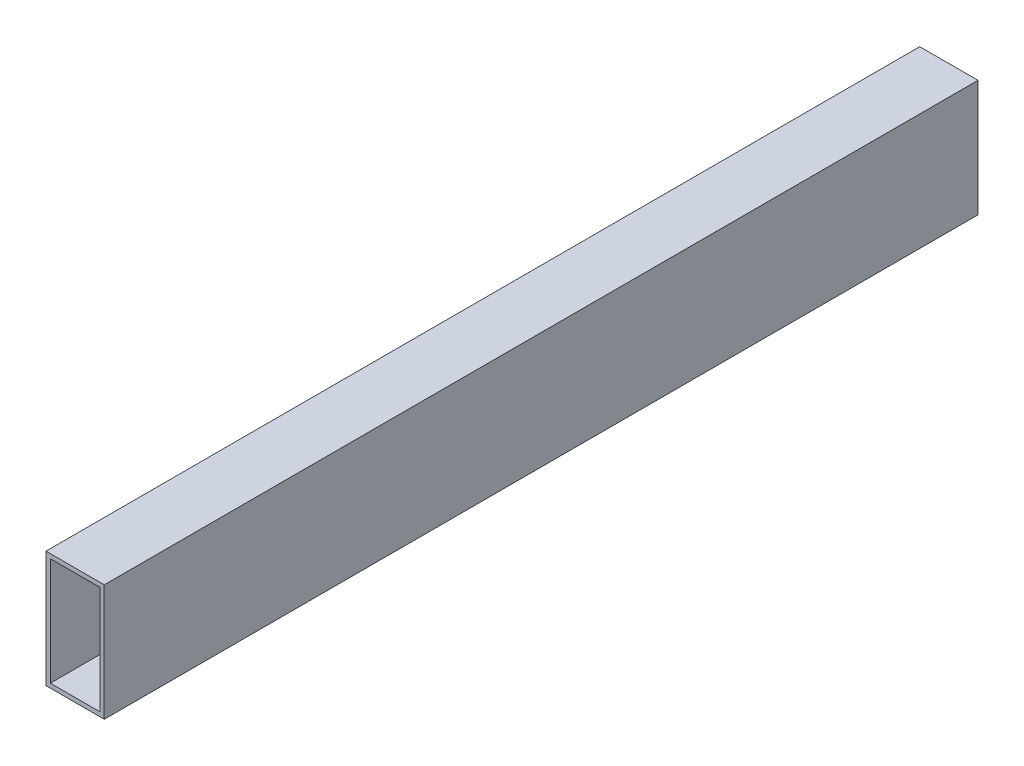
ISO-10303-21;
HEADER;
FILE_DESCRIPTION(('STEP AP214'),'2;1');
FILE_NAME('part.step','',(''),(''),'','','');
FILE_SCHEMA(('AUTOMOTIVE_DESIGN { 1 0 10303 214 1 1 1 1 }'));
ENDSEC;
DATA;
#1=APPLICATION_CONTEXT('core data for automotive mechanical design processes');
#2=APPLICATION_PROTOCOL_DEFINITION('international standard','automotive_design',2000,#1);
#3=PRODUCT_CONTEXT('',#1,'mechanical');
#4=PRODUCT('Part','Part','',(#3));
#5=PRODUCT_RELATED_PRODUCT_CATEGORY('part','',(#4));
#6=PRODUCT_DEFINITION_FORMATION('','',#4);
#7=PRODUCT_DEFINITION_CONTEXT('part definition',#1,'design');
#8=PRODUCT_DEFINITION('design','',#6,#7);
#9=PRODUCT_DEFINITION_SHAPE('','',#8);
#10=(LENGTH_UNIT() NAMED_UNIT(*) SI_UNIT(.MILLI.,.METRE.));
#11=(NAMED_UNIT(*) PLANE_ANGLE_UNIT() SI_UNIT($,.RADIAN.));
#12=(NAMED_UNIT(*) SI_UNIT($,.STERADIAN.) SOLID_ANGLE_UNIT());
#13=UNCERTAINTY_MEASURE_WITH_UNIT(LENGTH_MEASURE(1.E-05),#10,'distance_accuracy_value','');
#14=(GEOMETRIC_REPRESENTATION_CONTEXT(3) GLOBAL_UNCERTAINTY_ASSIGNED_CONTEXT((#13)) GLOBAL_UNIT_ASSIGNED_CONTEXT((#10,
#11,#12)) REPRESENTATION_CONTEXT('',''));
#15=CARTESIAN_POINT('',(0.,0.,0.));
#16=DIRECTION('',(0.,0.,1.));
#17=DIRECTION('',(1.,0.,0.));
#18=AXIS2_PLACEMENT_3D('',#15,#16,#17);
#19=CARTESIAN_POINT('',(-3659.88097263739,3096.4066057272,600.));
#20=DIRECTION('',(0.,0.,1.));
#21=DIRECTION('',(1.,0.,0.));
#22=AXIS2_PLACEMENT_3D('',#19,#20,#21);
#23=PLANE('',#22);
#24=DIRECTION('',(0.,-1.,0.));
#25=VECTOR('',#24,1.);
#26=CARTESIAN_POINT('',(-3659.88097263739,3176.4066057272,600.));
#27=LINE('',#26,#25);
#28=CARTESIAN_POINT('',(-3659.88097263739,3176.4066057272,600.));
#29=VERTEX_POINT('',#28);
#30=CARTESIAN_POINT('',(-3659.88097263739,3096.4066057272,600.));
#31=VERTEX_POINT('',#30);
#32=EDGE_CURVE('E133',#29,#31,#27,.T.);
#33=ORIENTED_EDGE('',*,*,#32,.T.);
#34=DIRECTION('',(1.,0.,0.));
#35=VECTOR('',#34,1.);
#36=CARTESIAN_POINT('',(-3659.88097263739,3096.4066057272,600.));
#37=LINE('',#36,#35);
#38=CARTESIAN_POINT('',(-3619.88097263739,3096.4066057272,600.));
#39=VERTEX_POINT('',#38);
#40=EDGE_CURVE('E136',#31,#39,#37,.T.);
#41=ORIENTED_EDGE('',*,*,#40,.T.);
#42=DIRECTION('',(0.,1.,0.));
#43=VECTOR('',#42,1.);
#44=CARTESIAN_POINT('',(-3619.88097263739,3176.4066057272,600.));
#45=LINE('',#44,#43);
#46=CARTESIAN_POINT('',(-3619.88097263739,3176.4066057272,600.));
#47=VERTEX_POINT('',#46);
#48=EDGE_CURVE('E138',#39,#47,#45,.T.);
#49=ORIENTED_EDGE('',*,*,#48,.T.);
#50=DIRECTION('',(-1.,0.,0.));
#51=VECTOR('',#50,1.);
#52=CARTESIAN_POINT('',(-3659.88097263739,3176.4066057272,600.));
#53=LINE('',#52,#51);
#54=EDGE_CURVE('E140',#47,#29,#53,.T.);
#55=ORIENTED_EDGE('',*,*,#54,.T.);
#56=EDGE_LOOP('',(#33,#41,#49,#55));
#57=FACE_BOUND('',#56,.T.);
#58=DIRECTION('',(0.,-1.,0.));
#59=VECTOR('',#58,1.);
#60=CARTESIAN_POINT('',(-3656.88097263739,3173.4066057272,600.));
#61=LINE('',#60,#59);
#62=CARTESIAN_POINT('',(-3656.88097263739,3173.4066057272,600.));
#63=VERTEX_POINT('',#62);
#64=CARTESIAN_POINT('',(-3656.88097263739,3099.4066057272,600.));
#65=VERTEX_POINT('',#64);
#66=EDGE_CURVE('E115',#63,#65,#61,.T.);
#67=ORIENTED_EDGE('',*,*,#66,.F.);
#68=DIRECTION('',(-1.,0.,0.));
#69=VECTOR('',#68,1.);
#70=CARTESIAN_POINT('',(-3656.88097263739,3173.4066057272,600.));
#71=LINE('',#70,#69);
#72=CARTESIAN_POINT('',(-3622.88097263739,3173.4066057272,600.));
#73=VERTEX_POINT('',#72);
#74=EDGE_CURVE('E104',#73,#63,#71,.T.);
#75=ORIENTED_EDGE('',*,*,#74,.F.);
#76=DIRECTION('',(0.,1.,0.));
#77=VECTOR('',#76,1.);
#78=CARTESIAN_POINT('',(-3622.88097263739,3173.4066057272,600.));
#79=LINE('',#78,#77);
#80=CARTESIAN_POINT('',(-3622.88097263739,3099.4066057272,600.));
#81=VERTEX_POINT('',#80);
#82=EDGE_CURVE('E119',#81,#73,#79,.T.);
#83=ORIENTED_EDGE('',*,*,#82,.F.);
#84=DIRECTION('',(1.,0.,0.));
#85=VECTOR('',#84,1.);
#86=CARTESIAN_POINT('',(-3656.88097263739,3099.4066057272,600.));
#87=LINE('',#86,#85);
#88=EDGE_CURVE('E117',#65,#81,#87,.T.);
#89=ORIENTED_EDGE('',*,*,#88,.F.);
#90=EDGE_LOOP('',(#67,#75,#83,#89));
#91=FACE_BOUND('',#90,.T.);
#92=ADVANCED_FACE('F24',(#57,#91),#23,.T.);
#93=CARTESIAN_POINT('',(-3659.88097263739,3096.4066057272,0.));
#94=DIRECTION('',(0.,0.,1.));
#95=DIRECTION('',(1.,0.,0.));
#96=AXIS2_PLACEMENT_3D('',#93,#94,#95);
#97=PLANE('',#96);
#98=DIRECTION('',(0.,-1.,0.));
#99=VECTOR('',#98,1.);
#100=CARTESIAN_POINT('',(-3659.88097263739,3176.4066057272,0.));
#101=LINE('',#100,#99);
#102=CARTESIAN_POINT('',(-3659.88097263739,3176.4066057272,0.));
#103=VERTEX_POINT('',#102);
#104=CARTESIAN_POINT('',(-3659.88097263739,3096.4066057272,0.));
#105=VERTEX_POINT('',#104);
#106=EDGE_CURVE('E105',#103,#105,#101,.T.);
#107=ORIENTED_EDGE('',*,*,#106,.F.);
#108=DIRECTION('',(-1.,0.,0.));
#109=VECTOR('',#108,1.);
#110=CARTESIAN_POINT('',(-3659.88097263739,3176.4066057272,0.));
#111=LINE('',#110,#109);
#112=CARTESIAN_POINT('',(-3619.88097263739,3176.4066057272,0.));
#113=VERTEX_POINT('',#112);
#114=EDGE_CURVE('E131',#113,#103,#111,.T.);
#115=ORIENTED_EDGE('',*,*,#114,.F.);
#116=DIRECTION('',(0.,1.,0.));
#117=VECTOR('',#116,1.);
#118=CARTESIAN_POINT('',(-3619.88097263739,3176.4066057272,0.));
#119=LINE('',#118,#117);
#120=CARTESIAN_POINT('',(-3619.88097263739,3096.4066057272,0.));
#121=VERTEX_POINT('',#120);
#122=EDGE_CURVE('E129',#121,#113,#119,.T.);
#123=ORIENTED_EDGE('',*,*,#122,.F.);
#124=DIRECTION('',(1.,0.,0.));
#125=VECTOR('',#124,1.);
#126=CARTESIAN_POINT('',(-3659.88097263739,3096.4066057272,0.));
#127=LINE('',#126,#125);
#128=EDGE_CURVE('E127',#105,#121,#127,.T.);
#129=ORIENTED_EDGE('',*,*,#128,.F.);
#130=EDGE_LOOP('',(#107,#115,#123,#129));
#131=FACE_BOUND('',#130,.T.);
#132=DIRECTION('',(-1.,0.,0.));
#133=VECTOR('',#132,1.);
#134=CARTESIAN_POINT('',(-3656.88097263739,3173.4066057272,0.));
#135=LINE('',#134,#133);
#136=CARTESIAN_POINT('',(-3622.88097263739,3173.4066057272,0.));
#137=VERTEX_POINT('',#136);
#138=CARTESIAN_POINT('',(-3656.88097263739,3173.4066057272,0.));
#139=VERTEX_POINT('',#138);
#140=EDGE_CURVE('E47',#137,#139,#135,.T.);
#141=ORIENTED_EDGE('',*,*,#140,.T.);
#142=DIRECTION('',(0.,-1.,0.));
#143=VECTOR('',#142,1.);
#144=CARTESIAN_POINT('',(-3656.88097263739,3173.4066057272,0.));
#145=LINE('',#144,#143);
#146=CARTESIAN_POINT('',(-3656.88097263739,3099.4066057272,0.));
#147=VERTEX_POINT('',#146);
#148=EDGE_CURVE('E91',#139,#147,#145,.T.);
#149=ORIENTED_EDGE('',*,*,#148,.T.);
#150=DIRECTION('',(1.,0.,0.));
#151=VECTOR('',#150,1.);
#152=CARTESIAN_POINT('',(-3656.88097263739,3099.4066057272,0.));
#153=LINE('',#152,#151);
#154=CARTESIAN_POINT('',(-3622.88097263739,3099.4066057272,0.));
#155=VERTEX_POINT('',#154);
#156=EDGE_CURVE('E100',#147,#155,#153,.T.);
#157=ORIENTED_EDGE('',*,*,#156,.T.);
#158=DIRECTION('',(0.,1.,0.));
#159=VECTOR('',#158,1.);
#160=CARTESIAN_POINT('',(-3622.88097263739,3173.4066057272,0.));
#161=LINE('',#160,#159);
#162=EDGE_CURVE('E109',#155,#137,#161,.T.);
#163=ORIENTED_EDGE('',*,*,#162,.T.);
#164=EDGE_LOOP('',(#141,#149,#157,#163));
#165=FACE_BOUND('',#164,.T.);
#166=ADVANCED_FACE('F108',(#131,#165),#97,.F.);
#167=CARTESIAN_POINT('',(-3659.88097263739,3176.4066057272,600.));
#168=DIRECTION('',(1.,0.,0.));
#169=DIRECTION('',(0.,0.,-1.));
#170=AXIS2_PLACEMENT_3D('',#167,#168,#169);
#171=PLANE('',#170);
#172=ORIENTED_EDGE('',*,*,#106,.T.);
#173=DIRECTION('',(0.,0.,-1.));
#174=VECTOR('',#173,1.);
#175=CARTESIAN_POINT('',(-3659.88097263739,3096.4066057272,600.));
#176=LINE('',#175,#174);
#177=EDGE_CURVE('E11',#31,#105,#176,.T.);
#178=ORIENTED_EDGE('',*,*,#177,.F.);
#179=ORIENTED_EDGE('',*,*,#32,.F.);
#180=DIRECTION('',(0.,0.,-1.));
#181=VECTOR('',#180,1.);
#182=CARTESIAN_POINT('',(-3659.88097263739,3176.4066057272,600.));
#183=LINE('',#182,#181);
#184=EDGE_CURVE('E142',#29,#103,#183,.T.);
#185=ORIENTED_EDGE('',*,*,#184,.T.);
#186=EDGE_LOOP('',(#172,#178,#179,#185));
#187=FACE_BOUND('',#186,.T.);
#188=ADVANCED_FACE('F26',(#187),#171,.F.);
#189=CARTESIAN_POINT('',(-3659.88097263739,3096.4066057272,600.));
#190=DIRECTION('',(0.,1.,0.));
#191=DIRECTION('',(0.,0.,1.));
#192=AXIS2_PLACEMENT_3D('',#189,#190,#191);
#193=PLANE('',#192);
#194=ORIENTED_EDGE('',*,*,#128,.T.);
#195=DIRECTION('',(0.,0.,-1.));
#196=VECTOR('',#195,1.);
#197=CARTESIAN_POINT('',(-3619.88097263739,3096.4066057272,600.));
#198=LINE('',#197,#196);
#199=EDGE_CURVE('E32',#39,#121,#198,.T.);
#200=ORIENTED_EDGE('',*,*,#199,.F.);
#201=ORIENTED_EDGE('',*,*,#40,.F.);
#202=ORIENTED_EDGE('',*,*,#177,.T.);
#203=EDGE_LOOP('',(#194,#200,#201,#202));
#204=FACE_BOUND('',#203,.T.);
#205=ADVANCED_FACE('F167',(#204),#193,.F.);
#206=CARTESIAN_POINT('',(-3619.88097263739,3176.4066057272,600.));
#207=DIRECTION('',(-1.,0.,0.));
#208=DIRECTION('',(0.,0.,1.));
#209=AXIS2_PLACEMENT_3D('',#206,#207,#208);
#210=PLANE('',#209);
#211=ORIENTED_EDGE('',*,*,#122,.T.);
#212=DIRECTION('',(0.,0.,-1.));
#213=VECTOR('',#212,1.);
#214=CARTESIAN_POINT('',(-3619.88097263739,3176.4066057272,600.));
#215=LINE('',#214,#213);
#216=EDGE_CURVE('E145',#47,#113,#215,.T.);
#217=ORIENTED_EDGE('',*,*,#216,.F.);
#218=ORIENTED_EDGE('',*,*,#48,.F.);
#219=ORIENTED_EDGE('',*,*,#199,.T.);
#220=EDGE_LOOP('',(#211,#217,#218,#219));
#221=FACE_BOUND('',#220,.T.);
#222=ADVANCED_FACE('F152',(#221),#210,.F.);
#223=CARTESIAN_POINT('',(-3659.88097263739,3176.4066057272,600.));
#224=DIRECTION('',(0.,-1.,0.));
#225=DIRECTION('',(0.,0.,-1.));
#226=AXIS2_PLACEMENT_3D('',#223,#224,#225);
#227=PLANE('',#226);
#228=ORIENTED_EDGE('',*,*,#114,.T.);
#229=ORIENTED_EDGE('',*,*,#184,.F.);
#230=ORIENTED_EDGE('',*,*,#54,.F.);
#231=ORIENTED_EDGE('',*,*,#216,.T.);
#232=EDGE_LOOP('',(#228,#229,#230,#231));
#233=FACE_BOUND('',#232,.T.);
#234=ADVANCED_FACE('F160',(#233),#227,.F.);
#235=CARTESIAN_POINT('',(-3656.88097263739,3173.4066057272,600.));
#236=DIRECTION('',(0.,-1.,0.));
#237=DIRECTION('',(0.,0.,-1.));
#238=AXIS2_PLACEMENT_3D('',#235,#236,#237);
#239=PLANE('',#238);
#240=ORIENTED_EDGE('',*,*,#140,.F.);
#241=DIRECTION('',(0.,0.,-1.));
#242=VECTOR('',#241,1.);
#243=CARTESIAN_POINT('',(-3622.88097263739,3173.4066057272,600.));
#244=LINE('',#243,#242);
#245=EDGE_CURVE('E121',#73,#137,#244,.T.);
#246=ORIENTED_EDGE('',*,*,#245,.F.);
#247=ORIENTED_EDGE('',*,*,#74,.T.);
#248=DIRECTION('',(0.,0.,-1.));
#249=VECTOR('',#248,1.);
#250=CARTESIAN_POINT('',(-3656.88097263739,3173.4066057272,600.));
#251=LINE('',#250,#249);
#252=EDGE_CURVE('E93',#63,#139,#251,.T.);
#253=ORIENTED_EDGE('',*,*,#252,.T.);
#254=EDGE_LOOP('',(#240,#246,#247,#253));
#255=FACE_BOUND('',#254,.T.);
#256=ADVANCED_FACE('F102',(#255),#239,.T.);
#257=CARTESIAN_POINT('',(-3656.88097263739,3173.4066057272,600.));
#258=DIRECTION('',(1.,0.,0.));
#259=DIRECTION('',(0.,0.,-1.));
#260=AXIS2_PLACEMENT_3D('',#257,#258,#259);
#261=PLANE('',#260);
#262=ORIENTED_EDGE('',*,*,#148,.F.);
#263=ORIENTED_EDGE('',*,*,#252,.F.);
#264=ORIENTED_EDGE('',*,*,#66,.T.);
#265=DIRECTION('',(0.,0.,-1.));
#266=VECTOR('',#265,1.);
#267=CARTESIAN_POINT('',(-3656.88097263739,3099.4066057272,600.));
#268=LINE('',#267,#266);
#269=EDGE_CURVE('E96',#65,#147,#268,.T.);
#270=ORIENTED_EDGE('',*,*,#269,.T.);
#271=EDGE_LOOP('',(#262,#263,#264,#270));
#272=FACE_BOUND('',#271,.T.);
#273=ADVANCED_FACE('F92',(#272),#261,.T.);
#274=CARTESIAN_POINT('',(-3656.88097263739,3099.4066057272,600.));
#275=DIRECTION('',(0.,1.,0.));
#276=DIRECTION('',(0.,0.,1.));
#277=AXIS2_PLACEMENT_3D('',#274,#275,#276);
#278=PLANE('',#277);
#279=ORIENTED_EDGE('',*,*,#156,.F.);
#280=ORIENTED_EDGE('',*,*,#269,.F.);
#281=ORIENTED_EDGE('',*,*,#88,.T.);
#282=DIRECTION('',(0.,0.,-1.));
#283=VECTOR('',#282,1.);
#284=CARTESIAN_POINT('',(-3622.88097263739,3099.4066057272,600.));
#285=LINE('',#284,#283);
#286=EDGE_CURVE('E39',#81,#155,#285,.T.);
#287=ORIENTED_EDGE('',*,*,#286,.T.);
#288=EDGE_LOOP('',(#279,#280,#281,#287));
#289=FACE_BOUND('',#288,.T.);
#290=ADVANCED_FACE('F189',(#289),#278,.T.);
#291=CARTESIAN_POINT('',(-3622.88097263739,3173.4066057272,600.));
#292=DIRECTION('',(-1.,0.,0.));
#293=DIRECTION('',(0.,0.,1.));
#294=AXIS2_PLACEMENT_3D('',#291,#292,#293);
#295=PLANE('',#294);
#296=ORIENTED_EDGE('',*,*,#162,.F.);
#297=ORIENTED_EDGE('',*,*,#286,.F.);
#298=ORIENTED_EDGE('',*,*,#82,.T.);
#299=ORIENTED_EDGE('',*,*,#245,.T.);
#300=EDGE_LOOP('',(#296,#297,#298,#299));
#301=FACE_BOUND('',#300,.T.);
#302=ADVANCED_FACE('F194',(#301),#295,.T.);
#303=CLOSED_SHELL('',(#92,#166,#188,#205,#222,#234,#256,#273,#290,#302));
#304=MANIFOLD_SOLID_BREP('B2',#303);
#305=ADVANCED_BREP_SHAPE_REPRESENTATION('',(#18,#304),#14);
#306=SHAPE_DEFINITION_REPRESENTATION(#9,#305);
ENDSEC;
END-ISO-10303-21;
